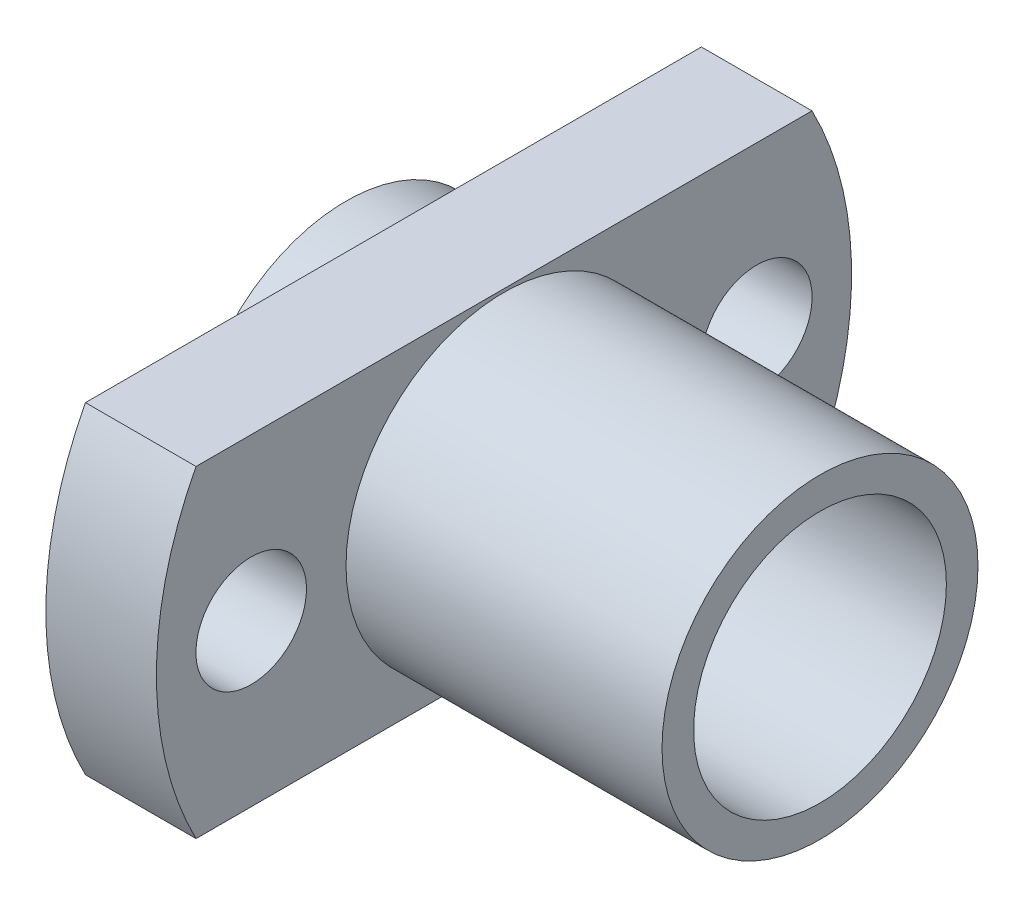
from build123d import *

# Parameters (mm, degrees)
SKETCH_1_R      = 5
SKETCH_1_R_2    = 4
EXTRUDE_1_DEPTH = 1.5
SKETCH_2_R      = 4
SKETCH_2_R_2    = 1.75
EXTRUDE_2_DEPTH = 3.5
SKETCH_3_R      = 5
SKETCH_3_R_2    = 4
EXTRUDE_3_DEPTH = 10


with BuildPart() as part:
    # Sketch 1 → Extrude 1 (new body)
    with BuildSketch(Plane(origin=(0, 0, 0), x_dir=(0, 0, -1), z_dir=(1, 0, 0))):
        Circle(SKETCH_1_R)
        Circle(SKETCH_1_R_2, mode=Mode.SUBTRACT)
    extrude(amount=EXTRUDE_1_DEPTH)

    # Sketch 2 → Extrude 2 (add)
    with BuildSketch(Plane(origin=(1.5, 0, 0), x_dir=(0, 0, -1), z_dir=(1, 0, 0))):
        with BuildLine():
            Line((-9.746281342, 5.1), (9.746281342, 5.1))
            ThreePointArc((9.746281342, 5.1), (11, 0), (9.746281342, -5.1))
            Line((9.746281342, -5.1), (-9.746281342, -5.1))
            ThreePointArc((-9.746281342, -5.1), (-11, 0), (-9.746281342, 5.1))
        make_face()
        Circle(SKETCH_2_R, mode=Mode.SUBTRACT)
        with Locations((-8, 0)):
            Circle(SKETCH_2_R_2, mode=Mode.SUBTRACT)
        with Locations((8, 0)):
            Circle(SKETCH_2_R_2, mode=Mode.SUBTRACT)
    extrude(amount=EXTRUDE_2_DEPTH)

    # Sketch 3 → Extrude 3 (add)
    with BuildSketch(Plane(origin=(5, 0, 0), x_dir=(0, 0, -1), z_dir=(1, 0, 0))):
        Circle(SKETCH_3_R)
        Circle(SKETCH_3_R_2, mode=Mode.SUBTRACT)
    extrude(amount=EXTRUDE_3_DEPTH)


solid = part.part
